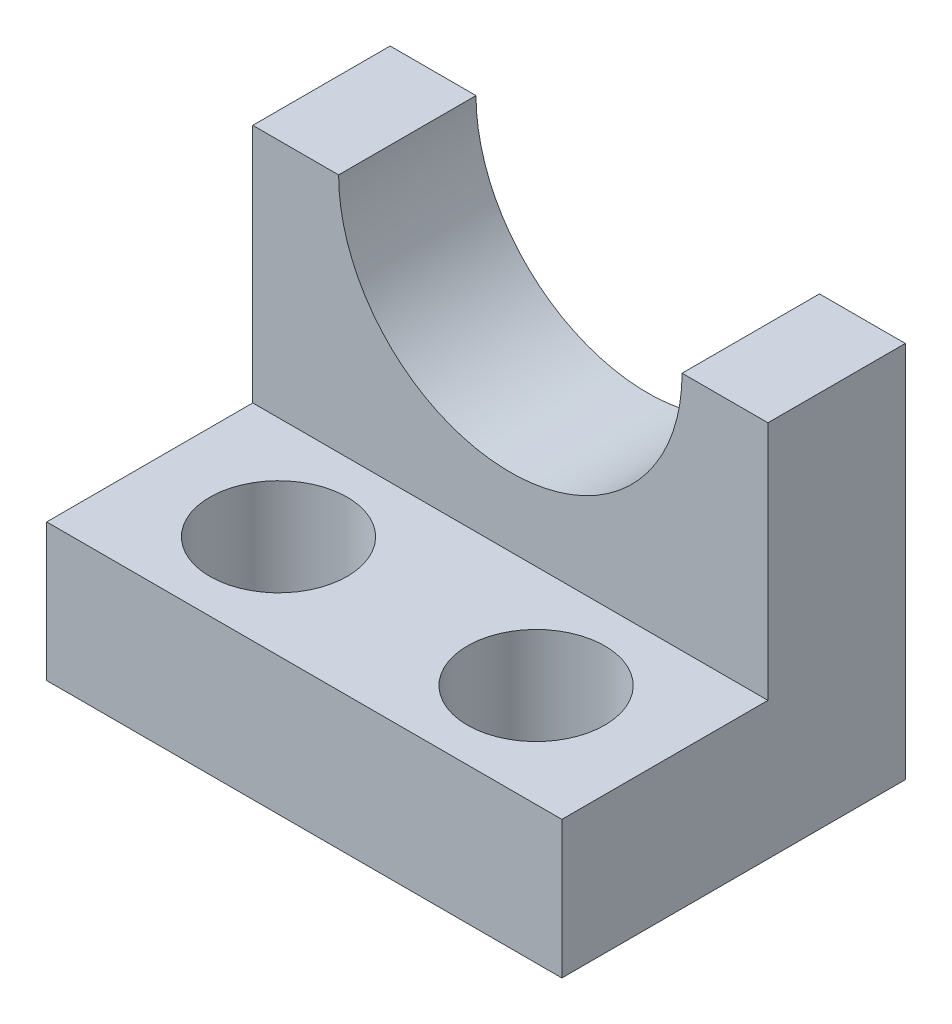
from build123d import *

# Parameters (mm, degrees)
SKETCH_1_W          = 30
SKETCH_1_H          = 20
EXTRUDE_1_DEPTH     = 8
SKETCH_2_W          = 30
SKETCH_2_H          = 8
EXTRUDE_2_DEPTH     = 14
SKETCH_3_R          = 4
CUT_EXTRUDE_1_DEPTH = 39.678159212
SKETCH_4_R          = 10
CUT_EXTRUDE_2_DEPTH = 40.089640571


with BuildPart() as part:
    # Sketch 1 → Extrude 1 (new body)
    with BuildSketch(Plane(origin=(0, 0, 0), x_dir=(1, 0, 0), z_dir=(0, 1, 0))):
        with Locations((15, 10)):
            Rectangle(SKETCH_1_W, SKETCH_1_H)
    extrude(amount=EXTRUDE_1_DEPTH)

    # Sketch 2 → Extrude 2 (add)
    with BuildSketch(Plane(origin=(0, 8, 0), x_dir=(1, 0, 0), z_dir=(0, 1, 0))):
        with Locations((15, 16)):
            Rectangle(SKETCH_2_W, SKETCH_2_H)
    extrude(amount=EXTRUDE_2_DEPTH)

    # Sketch 3 → Cut-Extrude 1 (cut, through all)
    with BuildSketch(Plane(origin=(0, 8, 0), x_dir=(1, 0, 0), z_dir=(0, 1, 0))):
        with Locations(Location((7.5, 6, 0), (0, 0, 270))):
            Circle(SKETCH_3_R)
        with Locations(Location((22.5, 6, 0), (0, 0, 270))):
            Circle(SKETCH_3_R)
    extrude(amount=-CUT_EXTRUDE_1_DEPTH, mode=Mode.SUBTRACT)

    # Sketch 4 → Cut-Extrude 2 (cut, through all)
    with BuildSketch(Plane.XY.offset(-12)):
        with Locations((15, 22)):
            Circle(SKETCH_4_R)
    extrude(amount=-CUT_EXTRUDE_2_DEPTH, mode=Mode.SUBTRACT)


solid = part.part
